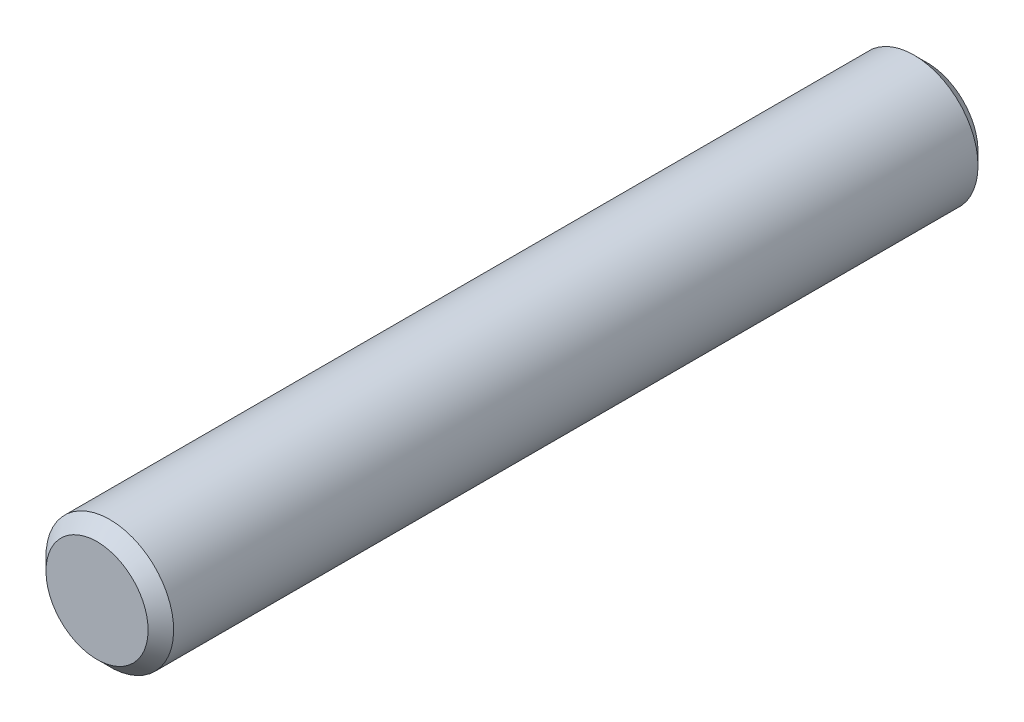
ISO-10303-21;
HEADER;
FILE_DESCRIPTION(('STEP AP214'),'2;1');
FILE_NAME('part.step','',(''),(''),'','','');
FILE_SCHEMA(('AUTOMOTIVE_DESIGN { 1 0 10303 214 1 1 1 1 }'));
ENDSEC;
DATA;
#1=APPLICATION_CONTEXT('core data for automotive mechanical design processes');
#2=APPLICATION_PROTOCOL_DEFINITION('international standard','automotive_design',2000,#1);
#3=PRODUCT_CONTEXT('',#1,'mechanical');
#4=PRODUCT('Part','Part','',(#3));
#5=PRODUCT_RELATED_PRODUCT_CATEGORY('part','',(#4));
#6=PRODUCT_DEFINITION_FORMATION('','',#4);
#7=PRODUCT_DEFINITION_CONTEXT('part definition',#1,'design');
#8=PRODUCT_DEFINITION('design','',#6,#7);
#9=PRODUCT_DEFINITION_SHAPE('','',#8);
#10=(LENGTH_UNIT() NAMED_UNIT(*) SI_UNIT(.MILLI.,.METRE.));
#11=(NAMED_UNIT(*) PLANE_ANGLE_UNIT() SI_UNIT($,.RADIAN.));
#12=(NAMED_UNIT(*) SI_UNIT($,.STERADIAN.) SOLID_ANGLE_UNIT());
#13=UNCERTAINTY_MEASURE_WITH_UNIT(LENGTH_MEASURE(1.E-05),#10,'distance_accuracy_value','');
#14=(GEOMETRIC_REPRESENTATION_CONTEXT(3) GLOBAL_UNCERTAINTY_ASSIGNED_CONTEXT((#13)) GLOBAL_UNIT_ASSIGNED_CONTEXT((#10,
#11,#12)) REPRESENTATION_CONTEXT('',''));
#15=CARTESIAN_POINT('',(0.,0.,0.));
#16=DIRECTION('',(0.,0.,1.));
#17=DIRECTION('',(1.,0.,0.));
#18=AXIS2_PLACEMENT_3D('',#15,#16,#17);
#19=CARTESIAN_POINT('',(0.,0.,13.));
#20=DIRECTION('',(0.,0.,1.));
#21=DIRECTION('',(0.,-1.,0.));
#22=AXIS2_PLACEMENT_3D('',#19,#20,#21);
#23=PLANE('',#22);
#24=CARTESIAN_POINT('',(0.,0.,12.9999999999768));
#25=DIRECTION('',(0.,0.,-1.));
#26=DIRECTION('',(0.,1.,0.));
#27=AXIS2_PLACEMENT_3D('',#24,#25,#26);
#28=CIRCLE('',#27,0.800000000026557);
#29=CARTESIAN_POINT('',(0.,0.800000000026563,12.9999999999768));
#30=VERTEX_POINT('',#29);
#31=EDGE_CURVE('E18',#30,#30,#28,.T.);
#32=ORIENTED_EDGE('',*,*,#31,.F.);
#33=EDGE_LOOP('',(#32));
#34=FACE_BOUND('',#33,.T.);
#35=ADVANCED_FACE('F15',(#34),#23,.T.);
#36=CARTESIAN_POINT('',(0.,0.,0.));
#37=DIRECTION('',(0.,0.,1.));
#38=DIRECTION('',(0.,-1.,0.));
#39=AXIS2_PLACEMENT_3D('',#36,#37,#38);
#40=PLANE('',#39);
#41=CARTESIAN_POINT('',(0.,0.,5.68434730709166E-11));
#42=DIRECTION('',(0.,0.,1.));
#43=DIRECTION('',(0.,-1.,0.));
#44=AXIS2_PLACEMENT_3D('',#41,#42,#43);
#45=CIRCLE('',#44,0.799999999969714);
#46=CARTESIAN_POINT('',(0.,-0.799999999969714,5.68437549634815E-11));
#47=VERTEX_POINT('',#46);
#48=EDGE_CURVE('E27',#47,#47,#45,.T.);
#49=ORIENTED_EDGE('',*,*,#48,.F.);
#50=EDGE_LOOP('',(#49));
#51=FACE_BOUND('',#50,.T.);
#52=ADVANCED_FACE('F38',(#51),#40,.F.);
#53=CARTESIAN_POINT('',(0.,0.,12.800000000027));
#54=DIRECTION('',(0.,0.,-1.));
#55=DIRECTION('',(0.,1.,0.));
#56=AXIS2_PLACEMENT_3D('',#53,#54,#55);
#57=CONICAL_SURFACE('',#56,0.999999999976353,0.785398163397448);
#58=CARTESIAN_POINT('',(0.,0.,12.8));
#59=DIRECTION('',(0.,0.,-1.));
#60=DIRECTION('',(0.,1.,0.));
#61=AXIS2_PLACEMENT_3D('',#58,#59,#60);
#62=CIRCLE('',#61,1.00000000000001);
#63=CARTESIAN_POINT('',(0.,1.00000000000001,12.8));
#64=VERTEX_POINT('',#63);
#65=EDGE_CURVE('E22',#64,#64,#62,.T.);
#66=ORIENTED_EDGE('',*,*,#65,.F.);
#67=EDGE_LOOP('',(#66));
#68=FACE_BOUND('',#67,.T.);
#69=ORIENTED_EDGE('',*,*,#31,.T.);
#70=EDGE_LOOP('',(#69));
#71=FACE_BOUND('',#70,.T.);
#72=ADVANCED_FACE('F35',(#68,#71),#57,.T.);
#73=CARTESIAN_POINT('',(0.,0.,0.199999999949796));
#74=DIRECTION('',(0.,0.,1.));
#75=DIRECTION('',(0.,-1.,0.));
#76=AXIS2_PLACEMENT_3D('',#73,#74,#75);
#77=CONICAL_SURFACE('',#76,0.999999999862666,0.785398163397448);
#78=CARTESIAN_POINT('',(0.,0.,0.200000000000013));
#79=DIRECTION('',(0.,0.,-1.));
#80=DIRECTION('',(0.,1.,0.));
#81=AXIS2_PLACEMENT_3D('',#78,#79,#80);
#82=CIRCLE('',#81,1.00000000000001);
#83=CARTESIAN_POINT('',(0.,1.00000000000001,0.200000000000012));
#84=VERTEX_POINT('',#83);
#85=EDGE_CURVE('E10',#84,#84,#82,.F.);
#86=ORIENTED_EDGE('',*,*,#85,.F.);
#87=EDGE_LOOP('',(#86));
#88=FACE_BOUND('',#87,.T.);
#89=ORIENTED_EDGE('',*,*,#48,.T.);
#90=EDGE_LOOP('',(#89));
#91=FACE_BOUND('',#90,.T.);
#92=ADVANCED_FACE('F46',(#88,#91),#77,.T.);
#93=CARTESIAN_POINT('',(0.,0.,13.));
#94=DIRECTION('',(0.,0.,-1.));
#95=DIRECTION('',(0.,1.,0.));
#96=AXIS2_PLACEMENT_3D('',#93,#94,#95);
#97=CYLINDRICAL_SURFACE('',#96,1.00000000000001);
#98=ORIENTED_EDGE('',*,*,#85,.T.);
#99=EDGE_LOOP('',(#98));
#100=FACE_BOUND('',#99,.T.);
#101=ORIENTED_EDGE('',*,*,#65,.T.);
#102=EDGE_LOOP('',(#101));
#103=FACE_BOUND('',#102,.T.);
#104=ADVANCED_FACE('F44',(#100,#103),#97,.T.);
#105=CLOSED_SHELL('',(#35,#52,#72,#92,#104));
#106=MANIFOLD_SOLID_BREP('B1',#105);
#107=ADVANCED_BREP_SHAPE_REPRESENTATION('',(#18,#106),#14);
#108=SHAPE_DEFINITION_REPRESENTATION(#9,#107);
ENDSEC;
END-ISO-10303-21;
